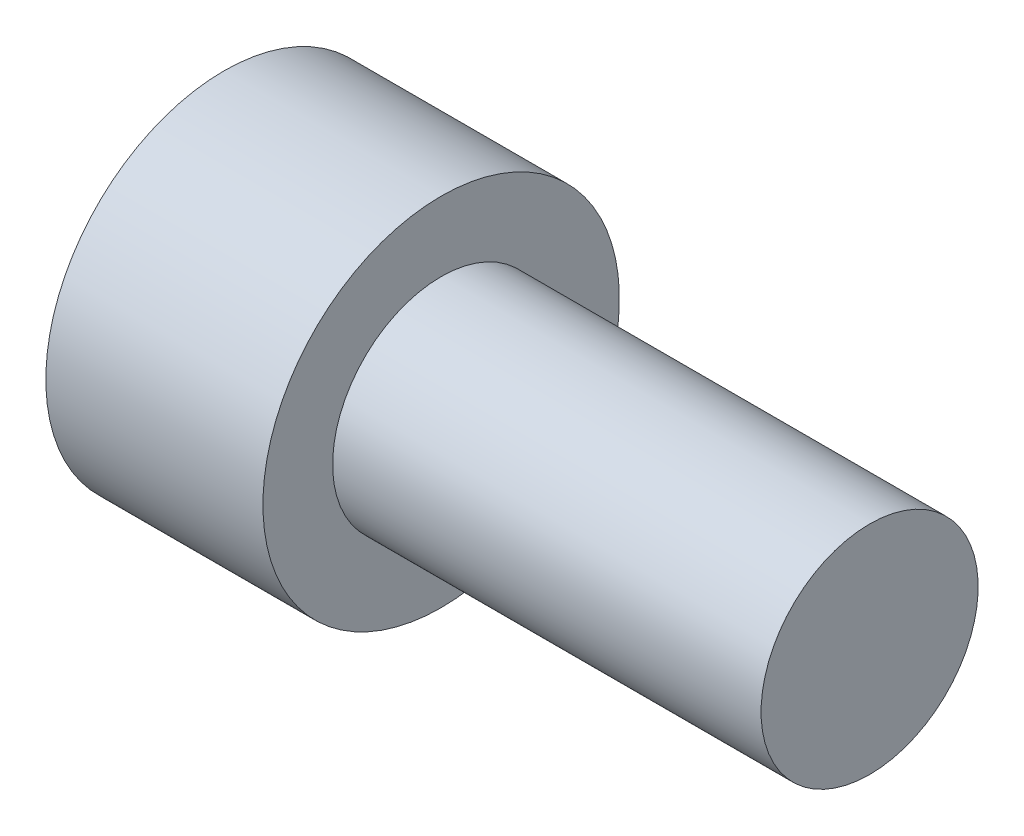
from build123d import *

# Parameters (mm, degrees)
CUT_EXTRUDE1_DEPTH = 2.286


with BuildPart() as part:
    # Sketch1 → Revolve1 (revolve)
    with BuildSketch(Plane.XY):
        Polygon((9.525, 0), (-4.826, 0), (-4.826, 3.9624), (0, 3.9624), (0, 2.413), (9.525, 2.413), align=None)
    revolve(axis=Axis((9.525, 0, 0), (-1, 0, 0)))

    # Sketch2 → Cut-Extrude1 (cut)
    with BuildSketch(Plane.ZY.offset(4.826)):
        Polygon((2.492998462, 0), (1.246499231, 2.159), (-1.246499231, 2.159), (-2.492998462, 0), (-1.246499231, -2.159), (1.246499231, -2.159), align=None)
    extrude(amount=-CUT_EXTRUDE1_DEPTH, mode=Mode.SUBTRACT)


solid = part.part
